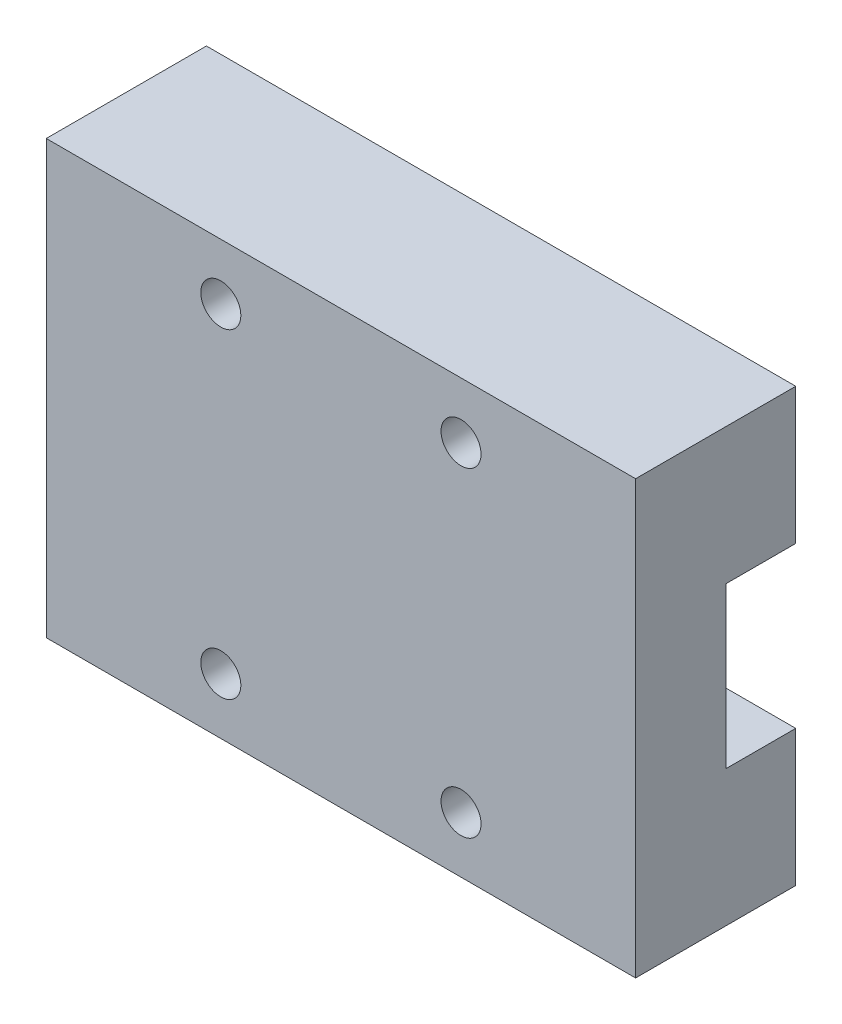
from build123d import *

# Parameters (mm, degrees)
SKETCH_1_W          = 36.8
SKETCH_1_H          = 27
SKETCH_1_R          = 1.25
EXTRUDE_1_DEPTH     = 10
SKETCH_2_W          = 7.38760836
SKETCH_2_H          = 10
CUT_EXTRUDE_1_DEPTH = 47.725153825


with BuildPart() as part:
    # Sketch 1 → Extrude 1 (new body)
    with BuildSketch(Plane.XY):
        with Locations((18.4, 13.5)):
            Rectangle(SKETCH_1_W, SKETCH_1_H)
        with Locations((10.9, 23.5)):
            Circle(SKETCH_1_R, mode=Mode.SUBTRACT)
        with Locations((25.9, 23.5)):
            Circle(SKETCH_1_R, mode=Mode.SUBTRACT)
        with Locations((10.9, 3.5)):
            Circle(SKETCH_1_R, mode=Mode.SUBTRACT)
        with Locations((25.9, 3.5)):
            Circle(SKETCH_1_R, mode=Mode.SUBTRACT)
    extrude(amount=EXTRUDE_1_DEPTH)

    # Sketch 2 → Cut-Extrude 1 (cut, through all)
    with BuildSketch(Plane(origin=(36.8, 0, 0), x_dir=(0, 0, -1), z_dir=(1, 0, 0))):
        with Locations((-0.65619582, 13.5)):
            Rectangle(SKETCH_2_W, SKETCH_2_H)
    extrude(amount=-CUT_EXTRUDE_1_DEPTH, mode=Mode.SUBTRACT)


solid = part.part
